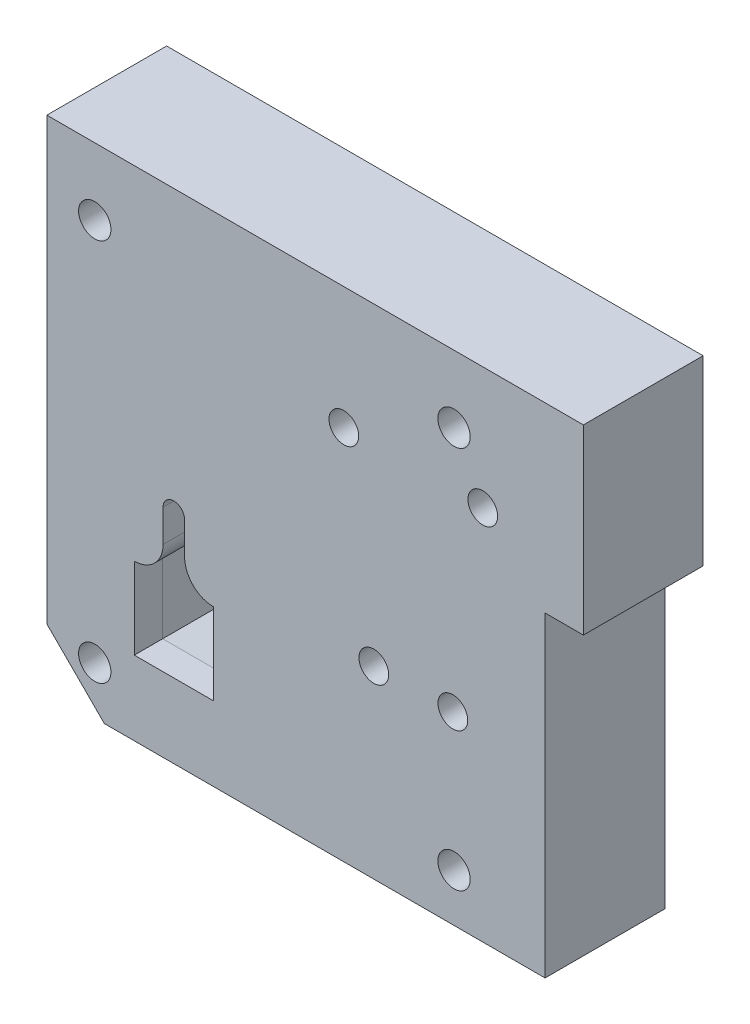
ISO-10303-21;
HEADER;
FILE_DESCRIPTION(('STEP AP214'),'2;1');
FILE_NAME('part.step','',(''),(''),'','','');
FILE_SCHEMA(('AUTOMOTIVE_DESIGN { 1 0 10303 214 1 1 1 1 }'));
ENDSEC;
DATA;
#1=APPLICATION_CONTEXT('core data for automotive mechanical design processes');
#2=APPLICATION_PROTOCOL_DEFINITION('international standard','automotive_design',2000,#1);
#3=PRODUCT_CONTEXT('',#1,'mechanical');
#4=PRODUCT('Part','Part','',(#3));
#5=PRODUCT_RELATED_PRODUCT_CATEGORY('part','',(#4));
#6=PRODUCT_DEFINITION_FORMATION('','',#4);
#7=PRODUCT_DEFINITION_CONTEXT('part definition',#1,'design');
#8=PRODUCT_DEFINITION('design','',#6,#7);
#9=PRODUCT_DEFINITION_SHAPE('','',#8);
#10=(LENGTH_UNIT() NAMED_UNIT(*) SI_UNIT(.MILLI.,.METRE.));
#11=(NAMED_UNIT(*) PLANE_ANGLE_UNIT() SI_UNIT($,.RADIAN.));
#12=(NAMED_UNIT(*) SI_UNIT($,.STERADIAN.) SOLID_ANGLE_UNIT());
#13=UNCERTAINTY_MEASURE_WITH_UNIT(LENGTH_MEASURE(1.E-05),#10,'distance_accuracy_value','');
#14=(GEOMETRIC_REPRESENTATION_CONTEXT(3) GLOBAL_UNCERTAINTY_ASSIGNED_CONTEXT((#13)) GLOBAL_UNIT_ASSIGNED_CONTEXT((#10,
#11,#12)) REPRESENTATION_CONTEXT('',''));
#15=CARTESIAN_POINT('',(0.,0.,0.));
#16=DIRECTION('',(0.,0.,1.));
#17=DIRECTION('',(1.,0.,0.));
#18=AXIS2_PLACEMENT_3D('',#15,#16,#17);
#19=CARTESIAN_POINT('',(9.00000000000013,122.,25.));
#20=DIRECTION('',(0.,0.,-1.));
#21=DIRECTION('',(-1.,0.,0.));
#22=AXIS2_PLACEMENT_3D('',#19,#20,#21);
#23=PLANE('',#22);
#24=CARTESIAN_POINT('',(186.,108.,25.));
#25=DIRECTION('',(0.,0.,-1.));
#26=DIRECTION('',(-1.,0.,0.));
#27=AXIS2_PLACEMENT_3D('',#24,#25,#26);
#28=CIRCLE('',#27,3.375);
#29=CARTESIAN_POINT('',(182.625,108.,25.));
#30=VERTEX_POINT('',#29);
#31=EDGE_CURVE('E533',#30,#30,#28,.T.);
#32=ORIENTED_EDGE('',*,*,#31,.T.);
#33=EDGE_LOOP('',(#32));
#34=FACE_BOUND('',#33,.T.);
#35=CARTESIAN_POINT('',(186.,27.9999999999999,25.));
#36=DIRECTION('',(0.,0.,-1.));
#37=DIRECTION('',(-1.,0.,0.));
#38=AXIS2_PLACEMENT_3D('',#35,#36,#37);
#39=CIRCLE('',#38,3.375);
#40=CARTESIAN_POINT('',(182.625,27.9999999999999,25.));
#41=VERTEX_POINT('',#40);
#42=EDGE_CURVE('E527',#41,#41,#39,.T.);
#43=ORIENTED_EDGE('',*,*,#42,.T.);
#44=EDGE_LOOP('',(#43));
#45=FACE_BOUND('',#44,.T.);
#46=CARTESIAN_POINT('',(111.,108.,25.));
#47=DIRECTION('',(0.,0.,-1.));
#48=DIRECTION('',(-1.,0.,0.));
#49=AXIS2_PLACEMENT_3D('',#46,#47,#48);
#50=CIRCLE('',#49,3.375);
#51=CARTESIAN_POINT('',(107.625,108.,25.));
#52=VERTEX_POINT('',#51);
#53=EDGE_CURVE('E521',#52,#52,#50,.T.);
#54=ORIENTED_EDGE('',*,*,#53,.T.);
#55=EDGE_LOOP('',(#54));
#56=FACE_BOUND('',#55,.T.);
#57=CARTESIAN_POINT('',(111.,28.,25.));
#58=DIRECTION('',(0.,0.,-1.));
#59=DIRECTION('',(-1.,0.,0.));
#60=AXIS2_PLACEMENT_3D('',#57,#58,#59);
#61=CIRCLE('',#60,3.375);
#62=CARTESIAN_POINT('',(107.625,28.,25.));
#63=VERTEX_POINT('',#62);
#64=EDGE_CURVE('E514',#63,#63,#61,.T.);
#65=ORIENTED_EDGE('',*,*,#64,.T.);
#66=EDGE_LOOP('',(#65));
#67=FACE_BOUND('',#66,.T.);
#68=CARTESIAN_POINT('',(185.75,56.5,25.));
#69=DIRECTION('',(0.,0.,1.));
#70=DIRECTION('',(1.,0.,0.));
#71=AXIS2_PLACEMENT_3D('',#68,#69,#70);
#72=CIRCLE('',#71,3.10000000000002);
#73=CARTESIAN_POINT('',(188.85,56.5,25.));
#74=VERTEX_POINT('',#73);
#75=EDGE_CURVE('E291',#74,#74,#72,.T.);
#76=ORIENTED_EDGE('',*,*,#75,.F.);
#77=EDGE_LOOP('',(#76));
#78=FACE_BOUND('',#77,.T.);
#79=CARTESIAN_POINT('',(192.,96.5,25.));
#80=DIRECTION('',(0.,0.,1.));
#81=DIRECTION('',(1.,0.,0.));
#82=AXIS2_PLACEMENT_3D('',#79,#80,#81);
#83=CIRCLE('',#82,3.09999999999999);
#84=CARTESIAN_POINT('',(195.1,96.5,25.));
#85=VERTEX_POINT('',#84);
#86=EDGE_CURVE('E303',#85,#85,#83,.T.);
#87=ORIENTED_EDGE('',*,*,#86,.F.);
#88=EDGE_LOOP('',(#87));
#89=FACE_BOUND('',#88,.T.);
#90=DIRECTION('',(0.707106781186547,-0.707106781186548,0.));
#91=VECTOR('',#90,1.);
#92=CARTESIAN_POINT('',(113.,18.,25.));
#93=LINE('',#92,#91);
#94=CARTESIAN_POINT('',(101.,30.,25.));
#95=VERTEX_POINT('',#94);
#96=CARTESIAN_POINT('',(113.,18.,25.));
#97=VERTEX_POINT('',#96);
#98=EDGE_CURVE('E327',#95,#97,#93,.T.);
#99=ORIENTED_EDGE('',*,*,#98,.T.);
#100=DIRECTION('',(1.,0.,0.));
#101=VECTOR('',#100,1.);
#102=CARTESIAN_POINT('',(113.,18.,25.));
#103=LINE('',#102,#101);
#104=CARTESIAN_POINT('',(205.,17.9999999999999,25.));
#105=VERTEX_POINT('',#104);
#106=EDGE_CURVE('E330',#97,#105,#103,.T.);
#107=ORIENTED_EDGE('',*,*,#106,.T.);
#108=DIRECTION('',(0.,1.,0.));
#109=VECTOR('',#108,1.);
#110=CARTESIAN_POINT('',(205.,17.9999999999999,25.));
#111=LINE('',#110,#109);
#112=CARTESIAN_POINT('',(205.,84.,25.));
#113=VERTEX_POINT('',#112);
#114=EDGE_CURVE('E332',#105,#113,#111,.T.);
#115=ORIENTED_EDGE('',*,*,#114,.T.);
#116=DIRECTION('',(1.,0.,0.));
#117=VECTOR('',#116,1.);
#118=CARTESIAN_POINT('',(213.,84.,25.));
#119=LINE('',#118,#117);
#120=CARTESIAN_POINT('',(213.,84.,25.));
#121=VERTEX_POINT('',#120);
#122=EDGE_CURVE('E334',#113,#121,#119,.T.);
#123=ORIENTED_EDGE('',*,*,#122,.T.);
#124=DIRECTION('',(0.,1.,0.));
#125=VECTOR('',#124,1.);
#126=CARTESIAN_POINT('',(213.,122.,25.));
#127=LINE('',#126,#125);
#128=CARTESIAN_POINT('',(213.,122.,25.));
#129=VERTEX_POINT('',#128);
#130=EDGE_CURVE('E336',#121,#129,#127,.T.);
#131=ORIENTED_EDGE('',*,*,#130,.T.);
#132=DIRECTION('',(-1.,0.,0.));
#133=VECTOR('',#132,1.);
#134=CARTESIAN_POINT('',(101.,122.,25.));
#135=LINE('',#134,#133);
#136=CARTESIAN_POINT('',(101.,122.,25.));
#137=VERTEX_POINT('',#136);
#138=EDGE_CURVE('E338',#129,#137,#135,.T.);
#139=ORIENTED_EDGE('',*,*,#138,.T.);
#140=DIRECTION('',(0.,-1.,0.));
#141=VECTOR('',#140,1.);
#142=CARTESIAN_POINT('',(101.,122.,25.));
#143=LINE('',#142,#141);
#144=EDGE_CURVE('E340',#137,#95,#143,.T.);
#145=ORIENTED_EDGE('',*,*,#144,.T.);
#146=EDGE_LOOP('',(#99,#107,#115,#123,#131,#139,#145));
#147=FACE_BOUND('',#146,.T.);
#148=CARTESIAN_POINT('',(163.,96.5,25.));
#149=DIRECTION('',(0.,0.,1.));
#150=DIRECTION('',(1.,0.,0.));
#151=AXIS2_PLACEMENT_3D('',#148,#149,#150);
#152=CIRCLE('',#151,3.10000000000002);
#153=CARTESIAN_POINT('',(166.1,96.5,25.));
#154=VERTEX_POINT('',#153);
#155=EDGE_CURVE('E309',#154,#154,#152,.T.);
#156=ORIENTED_EDGE('',*,*,#155,.F.);
#157=EDGE_LOOP('',(#156));
#158=FACE_BOUND('',#157,.T.);
#159=CARTESIAN_POINT('',(169.25,56.5,25.));
#160=DIRECTION('',(0.,0.,1.));
#161=DIRECTION('',(1.,0.,0.));
#162=AXIS2_PLACEMENT_3D('',#159,#160,#161);
#163=CIRCLE('',#162,3.10000000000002);
#164=CARTESIAN_POINT('',(172.35,56.5,25.));
#165=VERTEX_POINT('',#164);
#166=EDGE_CURVE('E297',#165,#165,#163,.T.);
#167=ORIENTED_EDGE('',*,*,#166,.F.);
#168=EDGE_LOOP('',(#167));
#169=FACE_BOUND('',#168,.T.);
#170=CARTESIAN_POINT('',(127.5,63.25,25.));
#171=DIRECTION('',(0.,0.,1.));
#172=DIRECTION('',(1.,0.,0.));
#173=AXIS2_PLACEMENT_3D('',#170,#171,#172);
#174=CIRCLE('',#173,2.25);
#175=CARTESIAN_POINT('',(129.75,63.25,25.));
#176=VERTEX_POINT('',#175);
#177=CARTESIAN_POINT('',(125.25,63.25,25.));
#178=VERTEX_POINT('',#177);
#179=EDGE_CURVE('E247',#176,#178,#174,.T.);
#180=ORIENTED_EDGE('',*,*,#179,.F.);
#181=DIRECTION('',(0.,1.,0.));
#182=VECTOR('',#181,1.);
#183=CARTESIAN_POINT('',(129.75,63.25,25.));
#184=LINE('',#183,#182);
#185=CARTESIAN_POINT('',(129.75,56.5,25.));
#186=VERTEX_POINT('',#185);
#187=EDGE_CURVE('E262',#186,#176,#184,.T.);
#188=ORIENTED_EDGE('',*,*,#187,.F.);
#189=CARTESIAN_POINT('',(135.75,56.5,25.));
#190=DIRECTION('',(0.,0.,-1.));
#191=DIRECTION('',(1.,0.,0.));
#192=AXIS2_PLACEMENT_3D('',#189,#190,#191);
#193=CIRCLE('',#192,6.00000000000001);
#194=CARTESIAN_POINT('',(135.75,50.5,25.));
#195=VERTEX_POINT('',#194);
#196=EDGE_CURVE('E259',#195,#186,#193,.T.);
#197=ORIENTED_EDGE('',*,*,#196,.F.);
#198=DIRECTION('',(0.,1.,0.));
#199=VECTOR('',#198,1.);
#200=CARTESIAN_POINT('',(135.75,50.5,25.));
#201=LINE('',#200,#199);
#202=CARTESIAN_POINT('',(135.75,33.5,25.));
#203=VERTEX_POINT('',#202);
#204=EDGE_CURVE('E257',#203,#195,#201,.T.);
#205=ORIENTED_EDGE('',*,*,#204,.F.);
#206=DIRECTION('',(1.,0.,0.));
#207=VECTOR('',#206,1.);
#208=CARTESIAN_POINT('',(135.75,33.5,25.));
#209=LINE('',#208,#207);
#210=CARTESIAN_POINT('',(119.25,33.5,25.));
#211=VERTEX_POINT('',#210);
#212=EDGE_CURVE('E255',#211,#203,#209,.T.);
#213=ORIENTED_EDGE('',*,*,#212,.F.);
#214=DIRECTION('',(0.,-1.,0.));
#215=VECTOR('',#214,1.);
#216=CARTESIAN_POINT('',(119.25,33.5,25.));
#217=LINE('',#216,#215);
#218=CARTESIAN_POINT('',(119.25,50.4999999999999,25.));
#219=VERTEX_POINT('',#218);
#220=EDGE_CURVE('E253',#219,#211,#217,.T.);
#221=ORIENTED_EDGE('',*,*,#220,.F.);
#222=CARTESIAN_POINT('',(119.25,56.5,25.));
#223=DIRECTION('',(0.,0.,-1.));
#224=DIRECTION('',(1.,0.,0.));
#225=AXIS2_PLACEMENT_3D('',#222,#223,#224);
#226=CIRCLE('',#225,6.00000000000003);
#227=CARTESIAN_POINT('',(125.25,56.5,25.));
#228=VERTEX_POINT('',#227);
#229=EDGE_CURVE('E251',#228,#219,#226,.T.);
#230=ORIENTED_EDGE('',*,*,#229,.F.);
#231=DIRECTION('',(0.,-1.,0.));
#232=VECTOR('',#231,1.);
#233=CARTESIAN_POINT('',(125.25,56.5,25.));
#234=LINE('',#233,#232);
#235=EDGE_CURVE('E249',#178,#228,#234,.T.);
#236=ORIENTED_EDGE('',*,*,#235,.F.);
#237=EDGE_LOOP('',(#180,#188,#197,#205,#213,#221,#230,#236));
#238=FACE_BOUND('',#237,.T.);
#239=ADVANCED_FACE('F31',(#34,#45,#56,#67,#78,#89,#147,#158,#169,#238),#23,.F.);
#240=CARTESIAN_POINT('',(9.00000000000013,122.,0.));
#241=DIRECTION('',(0.,0.,-1.));
#242=DIRECTION('',(-1.,0.,0.));
#243=AXIS2_PLACEMENT_3D('',#240,#241,#242);
#244=PLANE('',#243);
#245=CARTESIAN_POINT('',(186.,108.,0.));
#246=DIRECTION('',(0.,0.,-1.));
#247=DIRECTION('',(-1.,0.,0.));
#248=AXIS2_PLACEMENT_3D('',#245,#246,#247);
#249=CIRCLE('',#248,3.375);
#250=CARTESIAN_POINT('',(182.625,108.,0.));
#251=VERTEX_POINT('',#250);
#252=EDGE_CURVE('E535',#251,#251,#249,.T.);
#253=ORIENTED_EDGE('',*,*,#252,.F.);
#254=EDGE_LOOP('',(#253));
#255=FACE_BOUND('',#254,.T.);
#256=CARTESIAN_POINT('',(186.,27.9999999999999,0.));
#257=DIRECTION('',(0.,0.,-1.));
#258=DIRECTION('',(-1.,0.,0.));
#259=AXIS2_PLACEMENT_3D('',#256,#257,#258);
#260=CIRCLE('',#259,3.375);
#261=CARTESIAN_POINT('',(182.625,27.9999999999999,0.));
#262=VERTEX_POINT('',#261);
#263=EDGE_CURVE('E530',#262,#262,#260,.T.);
#264=ORIENTED_EDGE('',*,*,#263,.F.);
#265=EDGE_LOOP('',(#264));
#266=FACE_BOUND('',#265,.T.);
#267=CARTESIAN_POINT('',(111.,108.,0.));
#268=DIRECTION('',(0.,0.,-1.));
#269=DIRECTION('',(-1.,0.,0.));
#270=AXIS2_PLACEMENT_3D('',#267,#268,#269);
#271=CIRCLE('',#270,3.375);
#272=CARTESIAN_POINT('',(107.625,108.,0.));
#273=VERTEX_POINT('',#272);
#274=EDGE_CURVE('E524',#273,#273,#271,.T.);
#275=ORIENTED_EDGE('',*,*,#274,.F.);
#276=EDGE_LOOP('',(#275));
#277=FACE_BOUND('',#276,.T.);
#278=CARTESIAN_POINT('',(111.,28.,0.));
#279=DIRECTION('',(0.,0.,-1.));
#280=DIRECTION('',(-1.,0.,0.));
#281=AXIS2_PLACEMENT_3D('',#278,#279,#280);
#282=CIRCLE('',#281,3.375);
#283=CARTESIAN_POINT('',(107.625,28.,0.));
#284=VERTEX_POINT('',#283);
#285=EDGE_CURVE('E516',#284,#284,#282,.T.);
#286=ORIENTED_EDGE('',*,*,#285,.F.);
#287=EDGE_LOOP('',(#286));
#288=FACE_BOUND('',#287,.T.);
#289=CARTESIAN_POINT('',(127.5,63.25,0.));
#290=DIRECTION('',(0.,0.,-1.));
#291=DIRECTION('',(-1.,0.,0.));
#292=AXIS2_PLACEMENT_3D('',#289,#290,#291);
#293=CIRCLE('',#292,3.25000000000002);
#294=CARTESIAN_POINT('',(124.25,63.25,0.));
#295=VERTEX_POINT('',#294);
#296=CARTESIAN_POINT('',(130.75,63.25,0.));
#297=VERTEX_POINT('',#296);
#298=EDGE_CURVE('E46',#295,#297,#293,.T.);
#299=ORIENTED_EDGE('',*,*,#298,.F.);
#300=DIRECTION('',(0.,1.,0.));
#301=VECTOR('',#300,1.);
#302=CARTESIAN_POINT('',(124.25,56.5,0.));
#303=LINE('',#302,#301);
#304=CARTESIAN_POINT('',(124.25,56.5,0.));
#305=VERTEX_POINT('',#304);
#306=EDGE_CURVE('E195',#305,#295,#303,.T.);
#307=ORIENTED_EDGE('',*,*,#306,.F.);
#308=CARTESIAN_POINT('',(119.25,56.5,0.));
#309=DIRECTION('',(0.,0.,1.));
#310=DIRECTION('',(-1.,0.,0.));
#311=AXIS2_PLACEMENT_3D('',#308,#309,#310);
#312=CIRCLE('',#311,5.00000000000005);
#313=CARTESIAN_POINT('',(118.25,51.6010205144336,0.));
#314=VERTEX_POINT('',#313);
#315=EDGE_CURVE('E192',#314,#305,#312,.T.);
#316=ORIENTED_EDGE('',*,*,#315,.F.);
#317=DIRECTION('',(0.,1.,0.));
#318=VECTOR('',#317,1.);
#319=CARTESIAN_POINT('',(118.25,32.5,0.));
#320=LINE('',#319,#318);
#321=CARTESIAN_POINT('',(118.25,32.5,0.));
#322=VERTEX_POINT('',#321);
#323=EDGE_CURVE('E189',#322,#314,#320,.T.);
#324=ORIENTED_EDGE('',*,*,#323,.F.);
#325=DIRECTION('',(-1.,0.,0.));
#326=VECTOR('',#325,1.);
#327=CARTESIAN_POINT('',(136.75,32.5,0.));
#328=LINE('',#327,#326);
#329=CARTESIAN_POINT('',(136.75,32.5,0.));
#330=VERTEX_POINT('',#329);
#331=EDGE_CURVE('E183',#330,#322,#328,.T.);
#332=ORIENTED_EDGE('',*,*,#331,.F.);
#333=DIRECTION('',(0.,-1.,0.));
#334=VECTOR('',#333,1.);
#335=CARTESIAN_POINT('',(136.75,51.6010205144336,0.));
#336=LINE('',#335,#334);
#337=CARTESIAN_POINT('',(136.75,51.6010205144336,0.));
#338=VERTEX_POINT('',#337);
#339=EDGE_CURVE('E181',#338,#330,#336,.T.);
#340=ORIENTED_EDGE('',*,*,#339,.F.);
#341=CARTESIAN_POINT('',(135.75,56.5,0.));
#342=DIRECTION('',(0.,0.,1.));
#343=DIRECTION('',(-1.,0.,0.));
#344=AXIS2_PLACEMENT_3D('',#341,#342,#343);
#345=CIRCLE('',#344,5.00000000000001);
#346=CARTESIAN_POINT('',(130.75,56.5,0.));
#347=VERTEX_POINT('',#346);
#348=EDGE_CURVE('E164',#347,#338,#345,.T.);
#349=ORIENTED_EDGE('',*,*,#348,.F.);
#350=DIRECTION('',(0.,-1.,0.));
#351=VECTOR('',#350,1.);
#352=CARTESIAN_POINT('',(130.75,63.25,0.));
#353=LINE('',#352,#351);
#354=EDGE_CURVE('E173',#297,#347,#353,.T.);
#355=ORIENTED_EDGE('',*,*,#354,.F.);
#356=EDGE_LOOP('',(#299,#307,#316,#324,#332,#340,#349,#355));
#357=FACE_BOUND('',#356,.T.);
#358=CARTESIAN_POINT('',(185.75,56.5,0.));
#359=DIRECTION('',(0.,0.,1.));
#360=DIRECTION('',(1.,0.,0.));
#361=AXIS2_PLACEMENT_3D('',#358,#359,#360);
#362=CIRCLE('',#361,3.10000000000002);
#363=CARTESIAN_POINT('',(188.85,56.5,0.));
#364=VERTEX_POINT('',#363);
#365=EDGE_CURVE('E288',#364,#364,#362,.T.);
#366=ORIENTED_EDGE('',*,*,#365,.T.);
#367=EDGE_LOOP('',(#366));
#368=FACE_BOUND('',#367,.T.);
#369=CARTESIAN_POINT('',(192.,96.5,0.));
#370=DIRECTION('',(0.,0.,1.));
#371=DIRECTION('',(1.,0.,0.));
#372=AXIS2_PLACEMENT_3D('',#369,#370,#371);
#373=CIRCLE('',#372,3.09999999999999);
#374=CARTESIAN_POINT('',(195.1,96.5,0.));
#375=VERTEX_POINT('',#374);
#376=EDGE_CURVE('E300',#375,#375,#373,.T.);
#377=ORIENTED_EDGE('',*,*,#376,.T.);
#378=EDGE_LOOP('',(#377));
#379=FACE_BOUND('',#378,.T.);
#380=DIRECTION('',(0.707106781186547,-0.707106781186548,0.));
#381=VECTOR('',#380,1.);
#382=CARTESIAN_POINT('',(113.,18.,0.));
#383=LINE('',#382,#381);
#384=CARTESIAN_POINT('',(101.,30.,0.));
#385=VERTEX_POINT('',#384);
#386=CARTESIAN_POINT('',(113.,18.,0.));
#387=VERTEX_POINT('',#386);
#388=EDGE_CURVE('E312',#385,#387,#383,.T.);
#389=ORIENTED_EDGE('',*,*,#388,.F.);
#390=DIRECTION('',(0.,-1.,0.));
#391=VECTOR('',#390,1.);
#392=CARTESIAN_POINT('',(101.,122.,0.));
#393=LINE('',#392,#391);
#394=CARTESIAN_POINT('',(101.,122.,0.));
#395=VERTEX_POINT('',#394);
#396=EDGE_CURVE('E325',#395,#385,#393,.T.);
#397=ORIENTED_EDGE('',*,*,#396,.F.);
#398=DIRECTION('',(-1.,0.,0.));
#399=VECTOR('',#398,1.);
#400=CARTESIAN_POINT('',(101.,122.,0.));
#401=LINE('',#400,#399);
#402=CARTESIAN_POINT('',(213.,122.,0.));
#403=VERTEX_POINT('',#402);
#404=EDGE_CURVE('E323',#403,#395,#401,.T.);
#405=ORIENTED_EDGE('',*,*,#404,.F.);
#406=DIRECTION('',(0.,1.,0.));
#407=VECTOR('',#406,1.);
#408=CARTESIAN_POINT('',(213.,122.,0.));
#409=LINE('',#408,#407);
#410=CARTESIAN_POINT('',(213.,84.,0.));
#411=VERTEX_POINT('',#410);
#412=EDGE_CURVE('E321',#411,#403,#409,.T.);
#413=ORIENTED_EDGE('',*,*,#412,.F.);
#414=DIRECTION('',(1.,0.,0.));
#415=VECTOR('',#414,1.);
#416=CARTESIAN_POINT('',(213.,84.,0.));
#417=LINE('',#416,#415);
#418=CARTESIAN_POINT('',(205.,84.,0.));
#419=VERTEX_POINT('',#418);
#420=EDGE_CURVE('E319',#419,#411,#417,.T.);
#421=ORIENTED_EDGE('',*,*,#420,.F.);
#422=DIRECTION('',(0.,1.,0.));
#423=VECTOR('',#422,1.);
#424=CARTESIAN_POINT('',(205.,17.9999999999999,0.));
#425=LINE('',#424,#423);
#426=CARTESIAN_POINT('',(205.,17.9999999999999,0.));
#427=VERTEX_POINT('',#426);
#428=EDGE_CURVE('E317',#427,#419,#425,.T.);
#429=ORIENTED_EDGE('',*,*,#428,.F.);
#430=DIRECTION('',(1.,0.,0.));
#431=VECTOR('',#430,1.);
#432=CARTESIAN_POINT('',(113.,18.,0.));
#433=LINE('',#432,#431);
#434=EDGE_CURVE('E315',#387,#427,#433,.T.);
#435=ORIENTED_EDGE('',*,*,#434,.F.);
#436=EDGE_LOOP('',(#389,#397,#405,#413,#421,#429,#435));
#437=FACE_BOUND('',#436,.T.);
#438=CARTESIAN_POINT('',(163.,96.5,0.));
#439=DIRECTION('',(0.,0.,1.));
#440=DIRECTION('',(1.,0.,0.));
#441=AXIS2_PLACEMENT_3D('',#438,#439,#440);
#442=CIRCLE('',#441,3.10000000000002);
#443=CARTESIAN_POINT('',(166.1,96.5,0.));
#444=VERTEX_POINT('',#443);
#445=EDGE_CURVE('E306',#444,#444,#442,.T.);
#446=ORIENTED_EDGE('',*,*,#445,.T.);
#447=EDGE_LOOP('',(#446));
#448=FACE_BOUND('',#447,.T.);
#449=CARTESIAN_POINT('',(169.25,56.5,0.));
#450=DIRECTION('',(0.,0.,1.));
#451=DIRECTION('',(1.,0.,0.));
#452=AXIS2_PLACEMENT_3D('',#449,#450,#451);
#453=CIRCLE('',#452,3.10000000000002);
#454=CARTESIAN_POINT('',(172.35,56.5,0.));
#455=VERTEX_POINT('',#454);
#456=EDGE_CURVE('E294',#455,#455,#453,.T.);
#457=ORIENTED_EDGE('',*,*,#456,.T.);
#458=EDGE_LOOP('',(#457));
#459=FACE_BOUND('',#458,.T.);
#460=ADVANCED_FACE('F177',(#255,#266,#277,#288,#357,#368,#379,#437,#448,#459),#244,.T.);
#461=CARTESIAN_POINT('',(113.,18.,25.));
#462=DIRECTION('',(0.707106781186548,0.707106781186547,0.));
#463=DIRECTION('',(-0.707106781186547,0.707106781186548,0.));
#464=AXIS2_PLACEMENT_3D('',#461,#462,#463);
#465=PLANE('',#464);
#466=ORIENTED_EDGE('',*,*,#388,.T.);
#467=DIRECTION('',(0.,0.,-1.));
#468=VECTOR('',#467,1.);
#469=CARTESIAN_POINT('',(113.,18.,25.));
#470=LINE('',#469,#468);
#471=EDGE_CURVE('E39',#97,#387,#470,.T.);
#472=ORIENTED_EDGE('',*,*,#471,.F.);
#473=ORIENTED_EDGE('',*,*,#98,.F.);
#474=DIRECTION('',(0.,0.,-1.));
#475=VECTOR('',#474,1.);
#476=CARTESIAN_POINT('',(101.,30.,25.));
#477=LINE('',#476,#475);
#478=EDGE_CURVE('E342',#95,#385,#477,.T.);
#479=ORIENTED_EDGE('',*,*,#478,.T.);
#480=EDGE_LOOP('',(#466,#472,#473,#479));
#481=FACE_BOUND('',#480,.T.);
#482=ADVANCED_FACE('F33',(#481),#465,.F.);
#483=CARTESIAN_POINT('',(113.,18.,25.));
#484=DIRECTION('',(0.,1.,0.));
#485=DIRECTION('',(-1.,0.,0.));
#486=AXIS2_PLACEMENT_3D('',#483,#484,#485);
#487=PLANE('',#486);
#488=ORIENTED_EDGE('',*,*,#434,.T.);
#489=DIRECTION('',(0.,0.,-1.));
#490=VECTOR('',#489,1.);
#491=CARTESIAN_POINT('',(205.,17.9999999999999,25.));
#492=LINE('',#491,#490);
#493=EDGE_CURVE('E357',#105,#427,#492,.T.);
#494=ORIENTED_EDGE('',*,*,#493,.F.);
#495=ORIENTED_EDGE('',*,*,#106,.F.);
#496=ORIENTED_EDGE('',*,*,#471,.T.);
#497=EDGE_LOOP('',(#488,#494,#495,#496));
#498=FACE_BOUND('',#497,.T.);
#499=ADVANCED_FACE('F362',(#498),#487,.F.);
#500=CARTESIAN_POINT('',(205.,17.9999999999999,25.));
#501=DIRECTION('',(-1.,0.,0.));
#502=DIRECTION('',(0.,-1.,0.));
#503=AXIS2_PLACEMENT_3D('',#500,#501,#502);
#504=PLANE('',#503);
#505=ORIENTED_EDGE('',*,*,#428,.T.);
#506=DIRECTION('',(0.,0.,-1.));
#507=VECTOR('',#506,1.);
#508=CARTESIAN_POINT('',(205.,84.,25.));
#509=LINE('',#508,#507);
#510=EDGE_CURVE('E354',#113,#419,#509,.T.);
#511=ORIENTED_EDGE('',*,*,#510,.F.);
#512=ORIENTED_EDGE('',*,*,#114,.F.);
#513=ORIENTED_EDGE('',*,*,#493,.T.);
#514=EDGE_LOOP('',(#505,#511,#512,#513));
#515=FACE_BOUND('',#514,.T.);
#516=ADVANCED_FACE('F377',(#515),#504,.F.);
#517=CARTESIAN_POINT('',(213.,84.,25.));
#518=DIRECTION('',(0.,1.,0.));
#519=DIRECTION('',(0.,0.,1.));
#520=AXIS2_PLACEMENT_3D('',#517,#518,#519);
#521=PLANE('',#520);
#522=ORIENTED_EDGE('',*,*,#420,.T.);
#523=DIRECTION('',(0.,0.,-1.));
#524=VECTOR('',#523,1.);
#525=CARTESIAN_POINT('',(213.,84.,25.));
#526=LINE('',#525,#524);
#527=EDGE_CURVE('E351',#121,#411,#526,.T.);
#528=ORIENTED_EDGE('',*,*,#527,.F.);
#529=ORIENTED_EDGE('',*,*,#122,.F.);
#530=ORIENTED_EDGE('',*,*,#510,.T.);
#531=EDGE_LOOP('',(#522,#528,#529,#530));
#532=FACE_BOUND('',#531,.T.);
#533=ADVANCED_FACE('F381',(#532),#521,.F.);
#534=CARTESIAN_POINT('',(213.,122.,25.));
#535=DIRECTION('',(-1.,0.,0.));
#536=DIRECTION('',(0.,0.,1.));
#537=AXIS2_PLACEMENT_3D('',#534,#535,#536);
#538=PLANE('',#537);
#539=ORIENTED_EDGE('',*,*,#412,.T.);
#540=DIRECTION('',(0.,0.,-1.));
#541=VECTOR('',#540,1.);
#542=CARTESIAN_POINT('',(213.,122.,25.));
#543=LINE('',#542,#541);
#544=EDGE_CURVE('E348',#129,#403,#543,.T.);
#545=ORIENTED_EDGE('',*,*,#544,.F.);
#546=ORIENTED_EDGE('',*,*,#130,.F.);
#547=ORIENTED_EDGE('',*,*,#527,.T.);
#548=EDGE_LOOP('',(#539,#545,#546,#547));
#549=FACE_BOUND('',#548,.T.);
#550=ADVANCED_FACE('F395',(#549),#538,.F.);
#551=CARTESIAN_POINT('',(101.,122.,25.));
#552=DIRECTION('',(0.,-1.,0.));
#553=DIRECTION('',(0.,0.,-1.));
#554=AXIS2_PLACEMENT_3D('',#551,#552,#553);
#555=PLANE('',#554);
#556=ORIENTED_EDGE('',*,*,#404,.T.);
#557=DIRECTION('',(0.,0.,-1.));
#558=VECTOR('',#557,1.);
#559=CARTESIAN_POINT('',(101.,122.,25.));
#560=LINE('',#559,#558);
#561=EDGE_CURVE('E345',#137,#395,#560,.T.);
#562=ORIENTED_EDGE('',*,*,#561,.F.);
#563=ORIENTED_EDGE('',*,*,#138,.F.);
#564=ORIENTED_EDGE('',*,*,#544,.T.);
#565=EDGE_LOOP('',(#556,#562,#563,#564));
#566=FACE_BOUND('',#565,.T.);
#567=ADVANCED_FACE('F393',(#566),#555,.F.);
#568=CARTESIAN_POINT('',(101.,122.,25.));
#569=DIRECTION('',(1.,0.,0.));
#570=DIRECTION('',(0.,1.,0.));
#571=AXIS2_PLACEMENT_3D('',#568,#569,#570);
#572=PLANE('',#571);
#573=ORIENTED_EDGE('',*,*,#396,.T.);
#574=ORIENTED_EDGE('',*,*,#478,.F.);
#575=ORIENTED_EDGE('',*,*,#144,.F.);
#576=ORIENTED_EDGE('',*,*,#561,.T.);
#577=EDGE_LOOP('',(#573,#574,#575,#576));
#578=FACE_BOUND('',#577,.T.);
#579=ADVANCED_FACE('F391',(#578),#572,.F.);
#580=CARTESIAN_POINT('',(163.,96.5,25.));
#581=DIRECTION('',(0.,0.,-1.));
#582=DIRECTION('',(-1.,0.,0.));
#583=AXIS2_PLACEMENT_3D('',#580,#581,#582);
#584=CYLINDRICAL_SURFACE('',#583,3.10000000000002);
#585=ORIENTED_EDGE('',*,*,#155,.T.);
#586=EDGE_LOOP('',(#585));
#587=FACE_BOUND('',#586,.T.);
#588=ORIENTED_EDGE('',*,*,#445,.F.);
#589=EDGE_LOOP('',(#588));
#590=FACE_BOUND('',#589,.T.);
#591=ADVANCED_FACE('F417',(#587,#590),#584,.F.);
#592=CARTESIAN_POINT('',(192.,96.5,25.));
#593=DIRECTION('',(0.,0.,-1.));
#594=DIRECTION('',(-1.,0.,0.));
#595=AXIS2_PLACEMENT_3D('',#592,#593,#594);
#596=CYLINDRICAL_SURFACE('',#595,3.09999999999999);
#597=ORIENTED_EDGE('',*,*,#86,.T.);
#598=EDGE_LOOP('',(#597));
#599=FACE_BOUND('',#598,.T.);
#600=ORIENTED_EDGE('',*,*,#376,.F.);
#601=EDGE_LOOP('',(#600));
#602=FACE_BOUND('',#601,.T.);
#603=ADVANCED_FACE('F421',(#599,#602),#596,.F.);
#604=CARTESIAN_POINT('',(169.25,56.5,25.));
#605=DIRECTION('',(0.,0.,-1.));
#606=DIRECTION('',(-1.,0.,0.));
#607=AXIS2_PLACEMENT_3D('',#604,#605,#606);
#608=CYLINDRICAL_SURFACE('',#607,3.10000000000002);
#609=ORIENTED_EDGE('',*,*,#166,.T.);
#610=EDGE_LOOP('',(#609));
#611=FACE_BOUND('',#610,.T.);
#612=ORIENTED_EDGE('',*,*,#456,.F.);
#613=EDGE_LOOP('',(#612));
#614=FACE_BOUND('',#613,.T.);
#615=ADVANCED_FACE('F426',(#611,#614),#608,.F.);
#616=CARTESIAN_POINT('',(185.75,56.5,25.));
#617=DIRECTION('',(0.,0.,-1.));
#618=DIRECTION('',(-1.,0.,0.));
#619=AXIS2_PLACEMENT_3D('',#616,#617,#618);
#620=CYLINDRICAL_SURFACE('',#619,3.10000000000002);
#621=ORIENTED_EDGE('',*,*,#75,.T.);
#622=EDGE_LOOP('',(#621));
#623=FACE_BOUND('',#622,.T.);
#624=ORIENTED_EDGE('',*,*,#365,.F.);
#625=EDGE_LOOP('',(#624));
#626=FACE_BOUND('',#625,.T.);
#627=ADVANCED_FACE('F433',(#623,#626),#620,.F.);
#628=CARTESIAN_POINT('',(127.5,63.25,25.));
#629=DIRECTION('',(0.,0.,-1.));
#630=DIRECTION('',(-1.,0.,0.));
#631=AXIS2_PLACEMENT_3D('',#628,#629,#630);
#632=CYLINDRICAL_SURFACE('',#631,2.25);
#633=CARTESIAN_POINT('',(127.5,63.25,19.0811366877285));
#634=DIRECTION('',(0.,0.,-1.));
#635=DIRECTION('',(-1.,0.,0.));
#636=AXIS2_PLACEMENT_3D('',#633,#634,#635);
#637=CIRCLE('',#636,2.25);
#638=CARTESIAN_POINT('',(129.75,63.25,19.0811366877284));
#639=VERTEX_POINT('',#638);
#640=CARTESIAN_POINT('',(125.25,63.25,19.0811366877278));
#641=VERTEX_POINT('',#640);
#642=EDGE_CURVE('E235',#639,#641,#637,.F.);
#643=ORIENTED_EDGE('',*,*,#642,.F.);
#644=DIRECTION('',(0.,0.,-1.));
#645=VECTOR('',#644,1.);
#646=CARTESIAN_POINT('',(129.75,63.25,25.));
#647=LINE('',#646,#645);
#648=EDGE_CURVE('E264',#176,#639,#647,.T.);
#649=ORIENTED_EDGE('',*,*,#648,.F.);
#650=ORIENTED_EDGE('',*,*,#179,.T.);
#651=DIRECTION('',(0.,0.,-1.));
#652=VECTOR('',#651,1.);
#653=CARTESIAN_POINT('',(125.25,63.25,25.));
#654=LINE('',#653,#652);
#655=EDGE_CURVE('E285',#178,#641,#654,.T.);
#656=ORIENTED_EDGE('',*,*,#655,.T.);
#657=EDGE_LOOP('',(#643,#649,#650,#656));
#658=FACE_BOUND('',#657,.T.);
#659=ADVANCED_FACE('F437',(#658),#632,.F.);
#660=CARTESIAN_POINT('',(125.25,56.5,25.));
#661=DIRECTION('',(1.,0.,0.));
#662=DIRECTION('',(0.,1.,0.));
#663=AXIS2_PLACEMENT_3D('',#660,#661,#662);
#664=PLANE('',#663);
#665=DIRECTION('',(0.,-1.,-1.17690651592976E-13));
#666=VECTOR('',#665,1.);
#667=CARTESIAN_POINT('',(125.25,56.5000000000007,19.0811366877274));
#668=LINE('',#667,#666);
#669=CARTESIAN_POINT('',(125.25,56.5,19.0811366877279));
#670=VERTEX_POINT('',#669);
#671=EDGE_CURVE('E245',#641,#670,#668,.T.);
#672=ORIENTED_EDGE('',*,*,#671,.F.);
#673=ORIENTED_EDGE('',*,*,#655,.F.);
#674=ORIENTED_EDGE('',*,*,#235,.T.);
#675=DIRECTION('',(0.,0.,-1.));
#676=VECTOR('',#675,1.);
#677=CARTESIAN_POINT('',(125.25,56.5,25.));
#678=LINE('',#677,#676);
#679=EDGE_CURVE('E282',#228,#670,#678,.T.);
#680=ORIENTED_EDGE('',*,*,#679,.T.);
#681=EDGE_LOOP('',(#672,#673,#674,#680));
#682=FACE_BOUND('',#681,.T.);
#683=ADVANCED_FACE('F441',(#682),#664,.T.);
#684=CARTESIAN_POINT('',(119.25,56.5,25.));
#685=DIRECTION('',(0.,0.,-1.));
#686=DIRECTION('',(-1.,0.,0.));
#687=AXIS2_PLACEMENT_3D('',#684,#685,#686);
#688=CYLINDRICAL_SURFACE('',#687,6.00000000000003);
#689=CARTESIAN_POINT('',(119.25,56.5,19.0811366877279));
#690=DIRECTION('',(0.,0.,1.));
#691=DIRECTION('',(1.,0.,0.));
#692=AXIS2_PLACEMENT_3D('',#689,#690,#691);
#693=CIRCLE('',#692,6.00000000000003);
#694=CARTESIAN_POINT('',(119.25,50.4999999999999,19.0811366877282));
#695=VERTEX_POINT('',#694);
#696=EDGE_CURVE('E243',#670,#695,#693,.F.);
#697=ORIENTED_EDGE('',*,*,#696,.F.);
#698=ORIENTED_EDGE('',*,*,#679,.F.);
#699=ORIENTED_EDGE('',*,*,#229,.T.);
#700=DIRECTION('',(0.,0.,-1.));
#701=VECTOR('',#700,1.);
#702=CARTESIAN_POINT('',(119.25,50.4999999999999,25.));
#703=LINE('',#702,#701);
#704=EDGE_CURVE('E279',#219,#695,#703,.T.);
#705=ORIENTED_EDGE('',*,*,#704,.T.);
#706=EDGE_LOOP('',(#697,#698,#699,#705));
#707=FACE_BOUND('',#706,.T.);
#708=ADVANCED_FACE('F445',(#707),#688,.T.);
#709=CARTESIAN_POINT('',(119.25,33.5,25.));
#710=DIRECTION('',(1.,0.,0.));
#711=DIRECTION('',(0.,1.,0.));
#712=AXIS2_PLACEMENT_3D('',#709,#710,#711);
#713=PLANE('',#712);
#714=DIRECTION('',(0.,-1.,0.));
#715=VECTOR('',#714,1.);
#716=CARTESIAN_POINT('',(119.25,33.5,19.0811366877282));
#717=LINE('',#716,#715);
#718=CARTESIAN_POINT('',(119.25,33.5,19.0811366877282));
#719=VERTEX_POINT('',#718);
#720=EDGE_CURVE('E241',#695,#719,#717,.T.);
#721=ORIENTED_EDGE('',*,*,#720,.F.);
#722=ORIENTED_EDGE('',*,*,#704,.F.);
#723=ORIENTED_EDGE('',*,*,#220,.T.);
#724=DIRECTION('',(0.,0.,-1.));
#725=VECTOR('',#724,1.);
#726=CARTESIAN_POINT('',(119.25,33.5,25.));
#727=LINE('',#726,#725);
#728=EDGE_CURVE('E276',#211,#719,#727,.T.);
#729=ORIENTED_EDGE('',*,*,#728,.T.);
#730=EDGE_LOOP('',(#721,#722,#723,#729));
#731=FACE_BOUND('',#730,.T.);
#732=ADVANCED_FACE('F449',(#731),#713,.T.);
#733=CARTESIAN_POINT('',(135.75,33.5,25.));
#734=DIRECTION('',(0.,1.,0.));
#735=DIRECTION('',(0.,0.,1.));
#736=AXIS2_PLACEMENT_3D('',#733,#734,#735);
#737=PLANE('',#736);
#738=DIRECTION('',(1.,0.,0.));
#739=VECTOR('',#738,1.);
#740=CARTESIAN_POINT('',(135.75,33.5,19.0811366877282));
#741=LINE('',#740,#739);
#742=CARTESIAN_POINT('',(135.75,33.5,19.0811366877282));
#743=VERTEX_POINT('',#742);
#744=EDGE_CURVE('E239',#719,#743,#741,.T.);
#745=ORIENTED_EDGE('',*,*,#744,.F.);
#746=ORIENTED_EDGE('',*,*,#728,.F.);
#747=ORIENTED_EDGE('',*,*,#212,.T.);
#748=DIRECTION('',(0.,0.,-1.));
#749=VECTOR('',#748,1.);
#750=CARTESIAN_POINT('',(135.75,33.5,25.));
#751=LINE('',#750,#749);
#752=EDGE_CURVE('E273',#203,#743,#751,.T.);
#753=ORIENTED_EDGE('',*,*,#752,.T.);
#754=EDGE_LOOP('',(#745,#746,#747,#753));
#755=FACE_BOUND('',#754,.T.);
#756=ADVANCED_FACE('F453',(#755),#737,.T.);
#757=CARTESIAN_POINT('',(135.75,50.5,25.));
#758=DIRECTION('',(-1.,0.,0.));
#759=DIRECTION('',(0.,0.,1.));
#760=AXIS2_PLACEMENT_3D('',#757,#758,#759);
#761=PLANE('',#760);
#762=DIRECTION('',(0.,1.,0.));
#763=VECTOR('',#762,1.);
#764=CARTESIAN_POINT('',(135.75,50.5,19.0811366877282));
#765=LINE('',#764,#763);
#766=CARTESIAN_POINT('',(135.75,50.5,19.0811366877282));
#767=VERTEX_POINT('',#766);
#768=EDGE_CURVE('E237',#743,#767,#765,.T.);
#769=ORIENTED_EDGE('',*,*,#768,.F.);
#770=ORIENTED_EDGE('',*,*,#752,.F.);
#771=ORIENTED_EDGE('',*,*,#204,.T.);
#772=DIRECTION('',(0.,0.,-1.));
#773=VECTOR('',#772,1.);
#774=CARTESIAN_POINT('',(135.75,50.5,25.));
#775=LINE('',#774,#773);
#776=EDGE_CURVE('E270',#195,#767,#775,.T.);
#777=ORIENTED_EDGE('',*,*,#776,.T.);
#778=EDGE_LOOP('',(#769,#770,#771,#777));
#779=FACE_BOUND('',#778,.T.);
#780=ADVANCED_FACE('F457',(#779),#761,.T.);
#781=CARTESIAN_POINT('',(135.75,56.5,25.));
#782=DIRECTION('',(0.,0.,-1.));
#783=DIRECTION('',(-1.,0.,0.));
#784=AXIS2_PLACEMENT_3D('',#781,#782,#783);
#785=CYLINDRICAL_SURFACE('',#784,6.00000000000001);
#786=CARTESIAN_POINT('',(135.75,56.5,19.0811366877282));
#787=DIRECTION('',(0.,0.,1.));
#788=DIRECTION('',(1.,0.,0.));
#789=AXIS2_PLACEMENT_3D('',#786,#787,#788);
#790=CIRCLE('',#789,6.00000000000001);
#791=CARTESIAN_POINT('',(129.75,56.5,19.0811366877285));
#792=VERTEX_POINT('',#791);
#793=EDGE_CURVE('E167',#767,#792,#790,.F.);
#794=ORIENTED_EDGE('',*,*,#793,.F.);
#795=ORIENTED_EDGE('',*,*,#776,.F.);
#796=ORIENTED_EDGE('',*,*,#196,.T.);
#797=DIRECTION('',(0.,0.,-1.));
#798=VECTOR('',#797,1.);
#799=CARTESIAN_POINT('',(129.75,56.5,25.));
#800=LINE('',#799,#798);
#801=EDGE_CURVE('E267',#186,#792,#800,.T.);
#802=ORIENTED_EDGE('',*,*,#801,.T.);
#803=EDGE_LOOP('',(#794,#795,#796,#802));
#804=FACE_BOUND('',#803,.T.);
#805=ADVANCED_FACE('F461',(#804),#785,.T.);
#806=CARTESIAN_POINT('',(129.75,63.25,25.));
#807=DIRECTION('',(-1.,0.,0.));
#808=DIRECTION('',(0.,0.,1.));
#809=AXIS2_PLACEMENT_3D('',#806,#807,#808);
#810=PLANE('',#809);
#811=DIRECTION('',(0.,1.,0.));
#812=VECTOR('',#811,1.);
#813=CARTESIAN_POINT('',(129.75,63.2500000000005,19.0811366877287));
#814=LINE('',#813,#812);
#815=EDGE_CURVE('E11',#792,#639,#814,.T.);
#816=ORIENTED_EDGE('',*,*,#815,.F.);
#817=ORIENTED_EDGE('',*,*,#801,.F.);
#818=ORIENTED_EDGE('',*,*,#187,.T.);
#819=ORIENTED_EDGE('',*,*,#648,.T.);
#820=EDGE_LOOP('',(#816,#817,#818,#819));
#821=FACE_BOUND('',#820,.T.);
#822=ADVANCED_FACE('F465',(#821),#810,.T.);
#823=CARTESIAN_POINT('',(127.5,63.25,0.));
#824=DIRECTION('',(0.,0.,-1.));
#825=DIRECTION('',(-1.,0.,0.));
#826=AXIS2_PLACEMENT_3D('',#823,#824,#825);
#827=CONICAL_SURFACE('',#826,3.25000000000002,0.05235987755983);
#828=ORIENTED_EDGE('',*,*,#642,.T.);
#829=DIRECTION('',(-0.0523359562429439,0.,-0.998629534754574));
#830=VECTOR('',#829,1.);
#831=CARTESIAN_POINT('',(124.25,63.25,0.));
#832=LINE('',#831,#830);
#833=EDGE_CURVE('E198',#641,#295,#832,.T.);
#834=ORIENTED_EDGE('',*,*,#833,.T.);
#835=ORIENTED_EDGE('',*,*,#298,.T.);
#836=DIRECTION('',(0.0523359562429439,0.,-0.998629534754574));
#837=VECTOR('',#836,1.);
#838=CARTESIAN_POINT('',(130.75,63.25,0.));
#839=LINE('',#838,#837);
#840=EDGE_CURVE('E170',#639,#297,#839,.T.);
#841=ORIENTED_EDGE('',*,*,#840,.F.);
#842=EDGE_LOOP('',(#828,#834,#835,#841));
#843=FACE_BOUND('',#842,.T.);
#844=ADVANCED_FACE('F469',(#843),#827,.F.);
#845=CARTESIAN_POINT('',(124.25,56.5,0.));
#846=DIRECTION('',(-0.998629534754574,0.,0.0523359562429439));
#847=DIRECTION('',(0.052335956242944,0.,0.998629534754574));
#848=AXIS2_PLACEMENT_3D('',#845,#846,#847);
#849=PLANE('',#848);
#850=ORIENTED_EDGE('',*,*,#671,.T.);
#851=DIRECTION('',(-0.0523359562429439,0.,-0.998629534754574));
#852=VECTOR('',#851,1.);
#853=CARTESIAN_POINT('',(124.25,56.5,0.));
#854=LINE('',#853,#852);
#855=EDGE_CURVE('E200',#670,#305,#854,.T.);
#856=ORIENTED_EDGE('',*,*,#855,.T.);
#857=ORIENTED_EDGE('',*,*,#306,.T.);
#858=ORIENTED_EDGE('',*,*,#833,.F.);
#859=EDGE_LOOP('',(#850,#856,#857,#858));
#860=FACE_BOUND('',#859,.T.);
#861=ADVANCED_FACE('F471',(#860),#849,.F.);
#862=CARTESIAN_POINT('',(119.25,56.5,0.));
#863=DIRECTION('',(0.,0.,1.));
#864=DIRECTION('',(-1.,0.,0.));
#865=AXIS2_PLACEMENT_3D('',#862,#863,#864);
#866=CONICAL_SURFACE('',#865,5.00000000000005,0.05235987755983);
#867=ORIENTED_EDGE('',*,*,#696,.T.);
#868=CARTESIAN_POINT('',(119.560194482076,50.19743434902,25.));
#869=CARTESIAN_POINT('',(119.455714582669,50.2969363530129,23.0064047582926));
#870=CARTESIAN_POINT('',(119.351240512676,50.3987143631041,21.0129207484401));
#871=CARTESIAN_POINT('',(119.142308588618,50.6077382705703,17.0262621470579));
#872=CARTESIAN_POINT('',(119.037850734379,50.7149841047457,15.0330875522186));
#873=CARTESIAN_POINT('',(118.819475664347,50.9458830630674,10.8662429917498));
#874=CARTESIAN_POINT('',(118.705560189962,51.0701419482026,8.69260625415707));
#875=CARTESIAN_POINT('',(118.534707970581,51.2635275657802,5.43255170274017));
#876=CARTESIAN_POINT('',(118.477760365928,51.3291560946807,4.34592667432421));
#877=CARTESIAN_POINT('',(118.363873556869,51.4630422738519,2.17283690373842));
#878=CARTESIAN_POINT('',(118.306934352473,51.5312999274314,1.08637216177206));
#879=CARTESIAN_POINT('',(118.25,51.6010205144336,0.));
#880=B_SPLINE_CURVE_WITH_KNOTS('',3,(#868,#869,#870,#871,#872,#873,#874,#875,#876,#877,#878,
#879),.UNSPECIFIED.,.F.,.F.,(4,2,2,2,2,4),(0.,5.99642941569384,11.992789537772,18.5332620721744,
21.8035401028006,25.0738222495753),.UNSPECIFIED.);
#881=EDGE_CURVE('E227',#695,#314,#880,.T.);
#882=ORIENTED_EDGE('',*,*,#881,.T.);
#883=ORIENTED_EDGE('',*,*,#315,.T.);
#884=ORIENTED_EDGE('',*,*,#855,.F.);
#885=EDGE_LOOP('',(#867,#882,#883,#884));
#886=FACE_BOUND('',#885,.T.);
#887=ADVANCED_FACE('F222',(#886),#866,.T.);
#888=CARTESIAN_POINT('',(118.25,32.5,0.));
#889=DIRECTION('',(-0.998629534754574,0.,0.0523359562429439));
#890=DIRECTION('',(0.052335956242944,0.,0.998629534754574));
#891=AXIS2_PLACEMENT_3D('',#888,#889,#890);
#892=PLANE('',#891);
#893=ORIENTED_EDGE('',*,*,#720,.T.);
#894=DIRECTION('',(-0.0522644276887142,-0.052264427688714,-0.997264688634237));
#895=VECTOR('',#894,1.);
#896=CARTESIAN_POINT('',(118.30053405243,32.5505340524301,0.964247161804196));
#897=LINE('',#896,#895);
#898=EDGE_CURVE('E232',#719,#322,#897,.T.);
#899=ORIENTED_EDGE('',*,*,#898,.T.);
#900=ORIENTED_EDGE('',*,*,#323,.T.);
#901=ORIENTED_EDGE('',*,*,#881,.F.);
#902=EDGE_LOOP('',(#893,#899,#900,#901));
#903=FACE_BOUND('',#902,.T.);
#904=ADVANCED_FACE('F218',(#903),#892,.F.);
#905=CARTESIAN_POINT('',(136.75,32.5,0.));
#906=DIRECTION('',(0.,-0.998629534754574,0.0523359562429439));
#907=DIRECTION('',(0.,-0.052335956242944,-0.998629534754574));
#908=AXIS2_PLACEMENT_3D('',#905,#906,#907);
#909=PLANE('',#908);
#910=ORIENTED_EDGE('',*,*,#744,.T.);
#911=DIRECTION('',(0.052264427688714,-0.052264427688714,-0.997264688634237));
#912=VECTOR('',#911,1.);
#913=CARTESIAN_POINT('',(136.697824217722,32.5521757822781,0.995573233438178));
#914=LINE('',#913,#912);
#915=EDGE_CURVE('E208',#743,#330,#914,.T.);
#916=ORIENTED_EDGE('',*,*,#915,.T.);
#917=ORIENTED_EDGE('',*,*,#331,.T.);
#918=ORIENTED_EDGE('',*,*,#898,.F.);
#919=EDGE_LOOP('',(#910,#916,#917,#918));
#920=FACE_BOUND('',#919,.T.);
#921=ADVANCED_FACE('F216',(#920),#909,.F.);
#922=CARTESIAN_POINT('',(136.75,51.6010205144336,0.));
#923=DIRECTION('',(0.998629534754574,0.,0.0523359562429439));
#924=DIRECTION('',(0.052335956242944,0.,-0.998629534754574));
#925=AXIS2_PLACEMENT_3D('',#922,#923,#924);
#926=PLANE('',#925);
#927=ORIENTED_EDGE('',*,*,#768,.T.);
#928=CARTESIAN_POINT('',(135.439805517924,50.19743434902,25.));
#929=CARTESIAN_POINT('',(135.544285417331,50.2969363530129,23.0064047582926));
#930=CARTESIAN_POINT('',(135.648759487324,50.3987143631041,21.0129207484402));
#931=CARTESIAN_POINT('',(135.857691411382,50.6077382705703,17.0262621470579));
#932=CARTESIAN_POINT('',(135.962149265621,50.7149841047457,15.0330875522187));
#933=CARTESIAN_POINT('',(136.180524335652,50.9458830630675,10.8662429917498));
#934=CARTESIAN_POINT('',(136.294439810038,51.0701419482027,8.69260625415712));
#935=CARTESIAN_POINT('',(136.465292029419,51.2635275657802,5.4325517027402));
#936=CARTESIAN_POINT('',(136.522239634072,51.3291560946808,4.34592667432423));
#937=CARTESIAN_POINT('',(136.636126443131,51.4630422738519,2.17283690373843));
#938=CARTESIAN_POINT('',(136.693065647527,51.5312999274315,1.08637216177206));
#939=CARTESIAN_POINT('',(136.75,51.6010205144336,0.));
#940=B_SPLINE_CURVE_WITH_KNOTS('',3,(#928,#929,#930,#931,#932,#933,#934,#935,#936,#937,#938,
#939),.UNSPECIFIED.,.F.,.F.,(4,2,2,2,2,4),(0.,5.99642941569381,11.9927895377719,
18.5332620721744,21.8035401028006,25.0738222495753),.UNSPECIFIED.);
#941=EDGE_CURVE('E169',#767,#338,#940,.T.);
#942=ORIENTED_EDGE('',*,*,#941,.T.);
#943=ORIENTED_EDGE('',*,*,#339,.T.);
#944=ORIENTED_EDGE('',*,*,#915,.F.);
#945=EDGE_LOOP('',(#927,#942,#943,#944));
#946=FACE_BOUND('',#945,.T.);
#947=ADVANCED_FACE('F212',(#946),#926,.F.);
#948=CARTESIAN_POINT('',(135.75,56.5,0.));
#949=DIRECTION('',(0.,0.,1.));
#950=DIRECTION('',(-1.,0.,0.));
#951=AXIS2_PLACEMENT_3D('',#948,#949,#950);
#952=CONICAL_SURFACE('',#951,5.00000000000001,0.05235987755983);
#953=ORIENTED_EDGE('',*,*,#793,.T.);
#954=DIRECTION('',(0.0523359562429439,0.,-0.998629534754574));
#955=VECTOR('',#954,1.);
#956=CARTESIAN_POINT('',(130.75,56.5,0.));
#957=LINE('',#956,#955);
#958=EDGE_CURVE('E53',#792,#347,#957,.T.);
#959=ORIENTED_EDGE('',*,*,#958,.T.);
#960=ORIENTED_EDGE('',*,*,#348,.T.);
#961=ORIENTED_EDGE('',*,*,#941,.F.);
#962=EDGE_LOOP('',(#953,#959,#960,#961));
#963=FACE_BOUND('',#962,.T.);
#964=ADVANCED_FACE('F161',(#963),#952,.T.);
#965=CARTESIAN_POINT('',(130.75,63.25,0.));
#966=DIRECTION('',(0.998629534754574,0.,0.0523359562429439));
#967=DIRECTION('',(0.052335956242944,0.,-0.998629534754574));
#968=AXIS2_PLACEMENT_3D('',#965,#966,#967);
#969=PLANE('',#968);
#970=ORIENTED_EDGE('',*,*,#815,.T.);
#971=ORIENTED_EDGE('',*,*,#840,.T.);
#972=ORIENTED_EDGE('',*,*,#354,.T.);
#973=ORIENTED_EDGE('',*,*,#958,.F.);
#974=EDGE_LOOP('',(#970,#971,#972,#973));
#975=FACE_BOUND('',#974,.T.);
#976=ADVANCED_FACE('F174',(#975),#969,.F.);
#977=CARTESIAN_POINT('',(111.,28.,25.));
#978=DIRECTION('',(0.,0.,-1.));
#979=DIRECTION('',(-1.,0.,0.));
#980=AXIS2_PLACEMENT_3D('',#977,#978,#979);
#981=CYLINDRICAL_SURFACE('',#980,3.375);
#982=ORIENTED_EDGE('',*,*,#64,.F.);
#983=EDGE_LOOP('',(#982));
#984=FACE_BOUND('',#983,.T.);
#985=ORIENTED_EDGE('',*,*,#285,.T.);
#986=EDGE_LOOP('',(#985));
#987=FACE_BOUND('',#986,.T.);
#988=ADVANCED_FACE('F479',(#984,#987),#981,.F.);
#989=CARTESIAN_POINT('',(111.,108.,25.));
#990=DIRECTION('',(0.,0.,-1.));
#991=DIRECTION('',(-1.,0.,0.));
#992=AXIS2_PLACEMENT_3D('',#989,#990,#991);
#993=CYLINDRICAL_SURFACE('',#992,3.375);
#994=ORIENTED_EDGE('',*,*,#53,.F.);
#995=EDGE_LOOP('',(#994));
#996=FACE_BOUND('',#995,.T.);
#997=ORIENTED_EDGE('',*,*,#274,.T.);
#998=EDGE_LOOP('',(#997));
#999=FACE_BOUND('',#998,.T.);
#1000=ADVANCED_FACE('F548',(#996,#999),#993,.F.);
#1001=CARTESIAN_POINT('',(186.,27.9999999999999,25.));
#1002=DIRECTION('',(0.,0.,-1.));
#1003=DIRECTION('',(-1.,0.,0.));
#1004=AXIS2_PLACEMENT_3D('',#1001,#1002,#1003);
#1005=CYLINDRICAL_SURFACE('',#1004,3.375);
#1006=ORIENTED_EDGE('',*,*,#42,.F.);
#1007=EDGE_LOOP('',(#1006));
#1008=FACE_BOUND('',#1007,.T.);
#1009=ORIENTED_EDGE('',*,*,#263,.T.);
#1010=EDGE_LOOP('',(#1009));
#1011=FACE_BOUND('',#1010,.T.);
#1012=ADVANCED_FACE('F553',(#1008,#1011),#1005,.F.);
#1013=CARTESIAN_POINT('',(186.,108.,25.));
#1014=DIRECTION('',(0.,0.,-1.));
#1015=DIRECTION('',(-1.,0.,0.));
#1016=AXIS2_PLACEMENT_3D('',#1013,#1014,#1015);
#1017=CYLINDRICAL_SURFACE('',#1016,3.375);
#1018=ORIENTED_EDGE('',*,*,#31,.F.);
#1019=EDGE_LOOP('',(#1018));
#1020=FACE_BOUND('',#1019,.T.);
#1021=ORIENTED_EDGE('',*,*,#252,.T.);
#1022=EDGE_LOOP('',(#1021));
#1023=FACE_BOUND('',#1022,.T.);
#1024=ADVANCED_FACE('F539',(#1020,#1023),#1017,.F.);
#1025=CLOSED_SHELL('',(#239,#460,#482,#499,#516,#533,#550,#567,#579,#591,#603,#615,#627,#659,
#683,#708,#732,#756,#780,#805,#822,#844,#861,#887,#904,#921,#947,#964,#976,#988,#1000,#1012,#1024));
#1026=MANIFOLD_SOLID_BREP('B2',#1025);
#1027=ADVANCED_BREP_SHAPE_REPRESENTATION('',(#18,#1026),#14);
#1028=SHAPE_DEFINITION_REPRESENTATION(#9,#1027);
ENDSEC;
END-ISO-10303-21;
